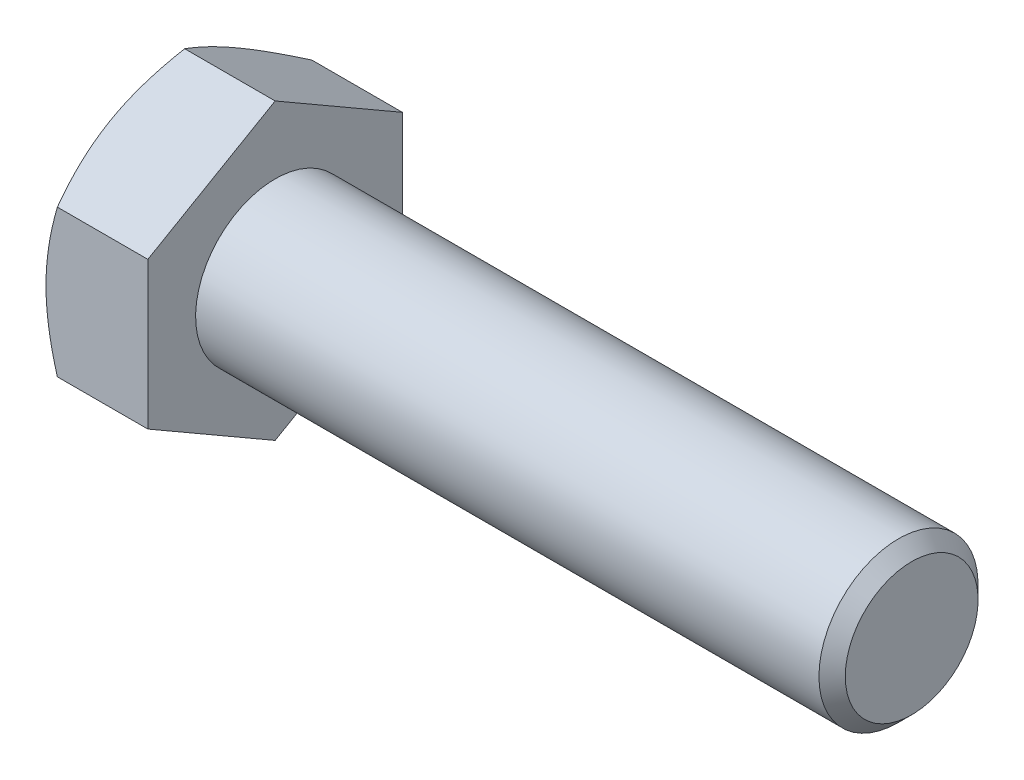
ISO-10303-21;
HEADER;
FILE_DESCRIPTION(('STEP AP214'),'2;1');
FILE_NAME('part.step','',(''),(''),'','','');
FILE_SCHEMA(('AUTOMOTIVE_DESIGN { 1 0 10303 214 1 1 1 1 }'));
ENDSEC;
DATA;
#1=APPLICATION_CONTEXT('core data for automotive mechanical design processes');
#2=APPLICATION_PROTOCOL_DEFINITION('international standard','automotive_design',2000,#1);
#3=PRODUCT_CONTEXT('',#1,'mechanical');
#4=PRODUCT('Part','Part','',(#3));
#5=PRODUCT_RELATED_PRODUCT_CATEGORY('part','',(#4));
#6=PRODUCT_DEFINITION_FORMATION('','',#4);
#7=PRODUCT_DEFINITION_CONTEXT('part definition',#1,'design');
#8=PRODUCT_DEFINITION('design','',#6,#7);
#9=PRODUCT_DEFINITION_SHAPE('','',#8);
#10=(LENGTH_UNIT() NAMED_UNIT(*) SI_UNIT(.MILLI.,.METRE.));
#11=(NAMED_UNIT(*) PLANE_ANGLE_UNIT() SI_UNIT($,.RADIAN.));
#12=(NAMED_UNIT(*) SI_UNIT($,.STERADIAN.) SOLID_ANGLE_UNIT());
#13=UNCERTAINTY_MEASURE_WITH_UNIT(LENGTH_MEASURE(1.E-05),#10,'distance_accuracy_value','');
#14=(GEOMETRIC_REPRESENTATION_CONTEXT(3) GLOBAL_UNCERTAINTY_ASSIGNED_CONTEXT((#13)) GLOBAL_UNIT_ASSIGNED_CONTEXT((#10,
#11,#12)) REPRESENTATION_CONTEXT('',''));
#15=CARTESIAN_POINT('',(0.,0.,0.));
#16=DIRECTION('',(0.,0.,1.));
#17=DIRECTION('',(1.,0.,0.));
#18=AXIS2_PLACEMENT_3D('',#15,#16,#17);
#19=CARTESIAN_POINT('',(0.,9.23760430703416,0.));
#20=DIRECTION('',(1.,0.,0.));
#21=DIRECTION('',(0.,1.,0.));
#22=AXIS2_PLACEMENT_3D('',#19,#20,#21);
#23=PLANE('',#22);
#24=CARTESIAN_POINT('',(0.,0.,0.));
#25=DIRECTION('',(1.,0.,0.));
#26=DIRECTION('',(0.,0.,-1.));
#27=AXIS2_PLACEMENT_3D('',#24,#25,#26);
#28=CIRCLE('',#27,8.00000000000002);
#29=CARTESIAN_POINT('',(0.,-6.92820323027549,-3.99999999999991));
#30=VERTEX_POINT('',#29);
#31=CARTESIAN_POINT('',(0.,0.,-7.99999999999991));
#32=VERTEX_POINT('',#31);
#33=EDGE_CURVE('E339',#30,#32,#28,.T.);
#34=ORIENTED_EDGE('',*,*,#33,.F.);
#35=CARTESIAN_POINT('',(0.,0.,0.));
#36=DIRECTION('',(1.,0.,0.));
#37=DIRECTION('',(0.,0.,-1.));
#38=AXIS2_PLACEMENT_3D('',#35,#36,#37);
#39=CIRCLE('',#38,8.);
#40=CARTESIAN_POINT('',(0.,-6.92820323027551,4.00000000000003));
#41=VERTEX_POINT('',#40);
#42=EDGE_CURVE('E338',#41,#30,#39,.T.);
#43=ORIENTED_EDGE('',*,*,#42,.F.);
#44=CARTESIAN_POINT('',(0.,0.,0.));
#45=DIRECTION('',(1.,0.,0.));
#46=DIRECTION('',(0.,0.,-1.));
#47=AXIS2_PLACEMENT_3D('',#44,#45,#46);
#48=CIRCLE('',#47,8.00000000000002);
#49=CARTESIAN_POINT('',(0.,0.,8.00000000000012));
#50=VERTEX_POINT('',#49);
#51=EDGE_CURVE('E88',#50,#41,#48,.T.);
#52=ORIENTED_EDGE('',*,*,#51,.F.);
#53=CARTESIAN_POINT('',(0.,0.,0.));
#54=DIRECTION('',(1.,0.,0.));
#55=DIRECTION('',(0.,0.,-1.));
#56=AXIS2_PLACEMENT_3D('',#53,#54,#55);
#57=CIRCLE('',#56,7.99999999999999);
#58=CARTESIAN_POINT('',(0.,6.92820323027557,4.00000000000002));
#59=VERTEX_POINT('',#58);
#60=EDGE_CURVE('E86',#59,#50,#57,.T.);
#61=ORIENTED_EDGE('',*,*,#60,.F.);
#62=CARTESIAN_POINT('',(0.,0.,0.));
#63=DIRECTION('',(1.,0.,0.));
#64=DIRECTION('',(0.,0.,-1.));
#65=AXIS2_PLACEMENT_3D('',#62,#63,#64);
#66=CIRCLE('',#65,8.);
#67=CARTESIAN_POINT('',(0.,6.92820323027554,-4.));
#68=VERTEX_POINT('',#67);
#69=EDGE_CURVE('E19',#68,#59,#66,.T.);
#70=ORIENTED_EDGE('',*,*,#69,.F.);
#71=CARTESIAN_POINT('',(0.,0.,0.));
#72=DIRECTION('',(1.,0.,0.));
#73=DIRECTION('',(0.,0.,-1.));
#74=AXIS2_PLACEMENT_3D('',#71,#72,#73);
#75=CIRCLE('',#74,7.99999999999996);
#76=EDGE_CURVE('E264',#32,#68,#75,.T.);
#77=ORIENTED_EDGE('',*,*,#76,.F.);
#78=EDGE_LOOP('',(#34,#43,#52,#61,#70,#77));
#79=FACE_BOUND('',#78,.T.);
#80=ADVANCED_FACE('F16',(#79),#23,.F.);
#81=CARTESIAN_POINT('',(0.718818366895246,0.,0.));
#82=DIRECTION('',(1.,0.,0.));
#83=DIRECTION('',(0.,0.,-1.));
#84=AXIS2_PLACEMENT_3D('',#81,#82,#83);
#85=CONICAL_SURFACE('',#84,9.24502993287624,1.0471975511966);
#86=CARTESIAN_POINT('',(0.714531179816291,9.23760430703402,0.));
#87=CARTESIAN_POINT('',(0.605971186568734,9.04962004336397,-0.325598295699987));
#88=CARTESIAN_POINT('',(0.506511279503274,8.8601303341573,-0.653804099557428));
#89=CARTESIAN_POINT('',(0.331115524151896,8.47948058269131,-1.31310880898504));
#90=CARTESIAN_POINT('',(0.255063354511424,8.28833381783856,-1.64418471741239));
#91=CARTESIAN_POINT('',(0.161684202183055,7.99980970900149,-2.14392313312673));
#92=CARTESIAN_POINT('',(0.133996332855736,7.90327053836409,-2.31113388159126));
#93=CARTESIAN_POINT('',(0.0860680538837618,7.70973002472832,-2.64635588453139));
#94=CARTESIAN_POINT('',(0.0658274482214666,7.61272869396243,-2.8143671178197));
#95=CARTESIAN_POINT('',(0.0331493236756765,7.41790506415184,-3.15181154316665));
#96=CARTESIAN_POINT('',(0.0207514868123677,7.32008108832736,-3.32124763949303));
#97=CARTESIAN_POINT('',(0.00415966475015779,7.1242407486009,-3.6604530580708));
#98=CARTESIAN_POINT('',(-3.26957018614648E-05,7.02622435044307,-3.83022243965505));
#99=CARTESIAN_POINT('',(0.,6.92820323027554,-4.));
#100=B_SPLINE_CURVE_WITH_KNOTS('',3,(#86,#87,#88,#89,#90,#91,#92,#93,#94,#95,#96,#97,#98,#99),
.UNSPECIFIED.,.F.,.F.,(4,2,2,2,2,2,4),(0.,1.17445865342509,2.34298309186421,2.9280119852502,
3.51302547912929,4.1009757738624,4.68904247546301),.UNSPECIFIED.);
#101=CARTESIAN_POINT('',(0.714531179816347,9.23760430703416,0.));
#102=VERTEX_POINT('',#101);
#103=EDGE_CURVE('E98',#102,#68,#100,.T.);
#104=ORIENTED_EDGE('',*,*,#103,.T.);
#105=ORIENTED_EDGE('',*,*,#69,.T.);
#106=CARTESIAN_POINT('',(0.,6.9282032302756,4.00000000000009));
#107=CARTESIAN_POINT('',(-3.26957018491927E-05,7.0262243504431,3.83022243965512));
#108=CARTESIAN_POINT('',(0.00415966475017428,7.12424074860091,3.66045305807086));
#109=CARTESIAN_POINT('',(0.0207514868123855,7.32008108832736,3.32124763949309));
#110=CARTESIAN_POINT('',(0.0331493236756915,7.41790506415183,3.15181154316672));
#111=CARTESIAN_POINT('',(0.0658274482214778,7.61272869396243,2.81436711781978));
#112=CARTESIAN_POINT('',(0.086068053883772,7.70973002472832,2.64635588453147));
#113=CARTESIAN_POINT('',(0.133996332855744,7.90327053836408,2.31113388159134));
#114=CARTESIAN_POINT('',(0.161684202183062,7.99980970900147,2.14392313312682));
#115=CARTESIAN_POINT('',(0.255063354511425,8.28833381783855,1.64418471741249));
#116=CARTESIAN_POINT('',(0.331115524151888,8.47948058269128,1.31310880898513));
#117=CARTESIAN_POINT('',(0.506511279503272,8.86013033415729,0.653804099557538));
#118=CARTESIAN_POINT('',(0.605971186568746,9.04962004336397,0.325598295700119));
#119=CARTESIAN_POINT('',(0.714531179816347,9.23760430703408,0.));
#120=B_SPLINE_CURVE_WITH_KNOTS('',3,(#106,#107,#108,#109,#110,#111,#112,#113,#114,#115,#116,
#117,#118,#119),.UNSPECIFIED.,.F.,.F.,(4,2,2,2,2,2,4),(0.,0.588066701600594,1.1760169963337,
1.76103049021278,2.34605938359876,3.51458382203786,4.68904247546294),.UNSPECIFIED.);
#121=EDGE_CURVE('E96',#59,#102,#120,.T.);
#122=ORIENTED_EDGE('',*,*,#121,.T.);
#123=EDGE_LOOP('',(#104,#105,#122));
#124=FACE_BOUND('',#123,.T.);
#125=ADVANCED_FACE('F94',(#124),#85,.T.);
#126=CARTESIAN_POINT('',(0.718818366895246,0.,0.));
#127=DIRECTION('',(1.,0.,0.));
#128=DIRECTION('',(0.,0.,-1.));
#129=AXIS2_PLACEMENT_3D('',#126,#127,#128);
#130=CONICAL_SURFACE('',#129,9.24502993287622,1.0471975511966);
#131=CARTESIAN_POINT('',(0.714531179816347,4.61880215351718,8.00000000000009));
#132=CARTESIAN_POINT('',(0.605971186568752,4.80678641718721,7.67440170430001));
#133=CARTESIAN_POINT('',(0.506511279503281,4.99627612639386,7.34619590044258));
#134=CARTESIAN_POINT('',(0.331115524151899,5.37692587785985,6.68689119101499));
#135=CARTESIAN_POINT('',(0.255063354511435,5.56807264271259,6.35581528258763));
#136=CARTESIAN_POINT('',(0.161684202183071,5.85659675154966,5.8560768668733));
#137=CARTESIAN_POINT('',(0.133996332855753,5.95313592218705,5.68886611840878));
#138=CARTESIAN_POINT('',(0.0860680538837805,6.14667643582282,5.35364411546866));
#139=CARTESIAN_POINT('',(0.0658274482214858,6.24367776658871,5.18563288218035));
#140=CARTESIAN_POINT('',(0.0331493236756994,6.4385013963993,4.84818845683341));
#141=CARTESIAN_POINT('',(0.020751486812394,6.53632537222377,4.67875236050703));
#142=CARTESIAN_POINT('',(0.00415966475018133,6.73216571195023,4.33954694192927));
#143=CARTESIAN_POINT('',(-3.26957018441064E-05,6.83018211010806,4.16977756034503));
#144=CARTESIAN_POINT('',(0.,6.9282032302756,4.00000000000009));
#145=B_SPLINE_CURVE_WITH_KNOTS('',3,(#131,#132,#133,#134,#135,#136,#137,#138,#139,#140,#141,
#142,#143,#144),.UNSPECIFIED.,.F.,.F.,(4,2,2,2,2,2,4),(0.,1.17445865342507,2.34298309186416,
2.92801198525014,3.51302547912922,4.10097577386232,4.68904247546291),.UNSPECIFIED.);
#146=CARTESIAN_POINT('',(0.714531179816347,4.61880215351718,8.00000000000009));
#147=VERTEX_POINT('',#146);
#148=EDGE_CURVE('E101',#147,#59,#145,.T.);
#149=ORIENTED_EDGE('',*,*,#148,.T.);
#150=ORIENTED_EDGE('',*,*,#60,.T.);
#151=CARTESIAN_POINT('',(0.,0.,8.00000000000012));
#152=CARTESIAN_POINT('',(-3.26957018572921E-05,0.196042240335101,8.00000000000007));
#153=CARTESIAN_POINT('',(0.00415966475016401,0.39207503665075,8.00000000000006));
#154=CARTESIAN_POINT('',(0.0207514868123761,0.783755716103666,8.00000000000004));
#155=CARTESIAN_POINT('',(0.0331493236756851,0.979403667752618,8.00000000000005));
#156=CARTESIAN_POINT('',(0.0658274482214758,1.36905092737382,8.00000000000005));
#157=CARTESIAN_POINT('',(0.0860680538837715,1.5630535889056,8.00000000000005));
#158=CARTESIAN_POINT('',(0.133996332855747,1.95013461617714,8.00000000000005));
#159=CARTESIAN_POINT('',(0.161684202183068,2.14321295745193,8.00000000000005));
#160=CARTESIAN_POINT('',(0.255063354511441,2.72026117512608,8.00000000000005));
#161=CARTESIAN_POINT('',(0.331115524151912,3.10255470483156,8.00000000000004));
#162=CARTESIAN_POINT('',(0.506511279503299,3.86385420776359,8.00000000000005));
#163=CARTESIAN_POINT('',(0.605971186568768,4.24283362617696,8.00000000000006));
#164=CARTESIAN_POINT('',(0.714531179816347,4.61880215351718,8.00000000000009));
#165=B_SPLINE_CURVE_WITH_KNOTS('',3,(#151,#152,#153,#154,#155,#156,#157,#158,#159,#160,#161,
#162,#163,#164),.UNSPECIFIED.,.F.,.F.,(4,2,2,2,2,2,4),(0.,0.588066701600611,1.17601699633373,
1.76103049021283,2.34605938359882,3.51458382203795,4.68904247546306),.UNSPECIFIED.);
#166=EDGE_CURVE('E104',#50,#147,#165,.T.);
#167=ORIENTED_EDGE('',*,*,#166,.T.);
#168=EDGE_LOOP('',(#149,#150,#167));
#169=FACE_BOUND('',#168,.T.);
#170=ADVANCED_FACE('F102',(#169),#130,.T.);
#171=CARTESIAN_POINT('',(0.718818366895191,0.,0.));
#172=DIRECTION('',(1.,0.,0.));
#173=DIRECTION('',(0.,0.,-1.));
#174=AXIS2_PLACEMENT_3D('',#171,#172,#173);
#175=CONICAL_SURFACE('',#174,9.24502993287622,1.0471975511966);
#176=ORIENTED_EDGE('',*,*,#51,.T.);
#177=CARTESIAN_POINT('',(0.,-6.92820323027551,4.00000000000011));
#178=CARTESIAN_POINT('',(-3.26957018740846E-05,-6.83018211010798,4.16977756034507));
#179=CARTESIAN_POINT('',(0.00415966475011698,-6.73216571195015,4.33954694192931));
#180=CARTESIAN_POINT('',(0.0207514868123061,-6.53632537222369,4.67875236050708));
#181=CARTESIAN_POINT('',(0.0331493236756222,-6.43850139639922,4.84818845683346));
#182=CARTESIAN_POINT('',(0.0658274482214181,-6.24367776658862,5.1856328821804));
#183=CARTESIAN_POINT('',(0.0860680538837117,-6.14667643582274,5.35364411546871));
#184=CARTESIAN_POINT('',(0.133996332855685,-5.95313592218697,5.68886611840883));
#185=CARTESIAN_POINT('',(0.161684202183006,-5.85659675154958,5.85607686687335));
#186=CARTESIAN_POINT('',(0.255063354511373,-5.56807264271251,6.35581528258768));
#187=CARTESIAN_POINT('',(0.331115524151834,-5.37692587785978,6.68689119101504));
#188=CARTESIAN_POINT('',(0.506511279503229,-4.99627612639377,7.34619590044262));
#189=CARTESIAN_POINT('',(0.605971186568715,-4.8067864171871,7.67440170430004));
#190=CARTESIAN_POINT('',(0.714531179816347,-4.61880215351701,8.00000000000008));
#191=B_SPLINE_CURVE_WITH_KNOTS('',3,(#177,#178,#179,#180,#181,#182,#183,#184,#185,#186,#187,
#188,#189,#190),.UNSPECIFIED.,.F.,.F.,(4,2,2,2,2,2,4),(0.,0.5880667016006,1.1760169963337,
1.76103049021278,2.34605938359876,3.51458382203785,4.68904247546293),.UNSPECIFIED.);
#192=CARTESIAN_POINT('',(0.714531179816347,-4.61880215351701,8.00000000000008));
#193=VERTEX_POINT('',#192);
#194=EDGE_CURVE('E179',#41,#193,#191,.T.);
#195=ORIENTED_EDGE('',*,*,#194,.T.);
#196=CARTESIAN_POINT('',(0.714531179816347,-4.61880215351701,8.00000000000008));
#197=CARTESIAN_POINT('',(0.605971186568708,-4.24283362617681,8.00000000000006));
#198=CARTESIAN_POINT('',(0.506511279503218,-3.86385420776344,8.00000000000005));
#199=CARTESIAN_POINT('',(0.331115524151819,-3.10255470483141,8.00000000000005));
#200=CARTESIAN_POINT('',(0.255063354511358,-2.72026117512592,8.00000000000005));
#201=CARTESIAN_POINT('',(0.161684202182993,-2.14321295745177,8.00000000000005));
#202=CARTESIAN_POINT('',(0.133996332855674,-1.95013461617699,8.00000000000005));
#203=CARTESIAN_POINT('',(0.0860680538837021,-1.56305358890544,8.00000000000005));
#204=CARTESIAN_POINT('',(0.0658274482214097,-1.36905092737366,8.00000000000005));
#205=CARTESIAN_POINT('',(0.0331493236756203,-0.979403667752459,8.00000000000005));
#206=CARTESIAN_POINT('',(0.0207514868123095,-0.783755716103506,8.00000000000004));
#207=CARTESIAN_POINT('',(0.00415966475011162,-0.392075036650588,8.00000000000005));
#208=CARTESIAN_POINT('',(-3.26957018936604E-05,-0.196042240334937,8.00000000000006));
#209=CARTESIAN_POINT('',(0.,1.11022302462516E-13,8.00000000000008));
#210=B_SPLINE_CURVE_WITH_KNOTS('',3,(#196,#197,#198,#199,#200,#201,#202,#203,#204,#205,#206,
#207,#208,#209),.UNSPECIFIED.,.F.,.F.,(4,2,2,2,2,2,4),(0.,1.17445865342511,2.34298309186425,
2.92801198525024,3.51302547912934,4.10097577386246,4.68904247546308),.UNSPECIFIED.);
#211=EDGE_CURVE('E151',#193,#50,#210,.T.);
#212=ORIENTED_EDGE('',*,*,#211,.T.);
#213=EDGE_LOOP('',(#176,#195,#212));
#214=FACE_BOUND('',#213,.T.);
#215=ADVANCED_FACE('F141',(#214),#175,.T.);
#216=CARTESIAN_POINT('',(0.718818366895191,0.,0.));
#217=DIRECTION('',(1.,0.,0.));
#218=DIRECTION('',(0.,0.,-1.));
#219=AXIS2_PLACEMENT_3D('',#216,#217,#218);
#220=CONICAL_SURFACE('',#219,9.24502993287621,1.0471975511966);
#221=ORIENTED_EDGE('',*,*,#42,.T.);
#222=CARTESIAN_POINT('',(0.,-6.92820323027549,-3.99999999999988));
#223=CARTESIAN_POINT('',(-3.26957020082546E-05,-7.02622435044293,-3.83022243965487));
#224=CARTESIAN_POINT('',(0.00415966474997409,-7.12424074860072,-3.6604530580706));
#225=CARTESIAN_POINT('',(0.0207514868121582,-7.32008108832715,-3.32124763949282));
#226=CARTESIAN_POINT('',(0.0331493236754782,-7.41790506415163,-3.15181154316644));
#227=CARTESIAN_POINT('',(0.0658274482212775,-7.61272869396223,-2.81436711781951));
#228=CARTESIAN_POINT('',(0.0860680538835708,-7.70973002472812,-2.64635588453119));
#229=CARTESIAN_POINT('',(0.133996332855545,-7.90327053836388,-2.31113388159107));
#230=CARTESIAN_POINT('',(0.161684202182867,-7.99980970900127,-2.14392313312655));
#231=CARTESIAN_POINT('',(0.255063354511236,-8.28833381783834,-1.64418471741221));
#232=CARTESIAN_POINT('',(0.331115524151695,-8.47948058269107,-1.31310880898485));
#233=CARTESIAN_POINT('',(0.506511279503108,-8.86013033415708,-0.653804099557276));
#234=CARTESIAN_POINT('',(0.605971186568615,-9.04962004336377,-0.325598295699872));
#235=CARTESIAN_POINT('',(0.714531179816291,-9.23760430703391,1.2490009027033E-13));
#236=B_SPLINE_CURVE_WITH_KNOTS('',3,(#222,#223,#224,#225,#226,#227,#228,#229,#230,#231,#232,
#233,#234,#235),.UNSPECIFIED.,.F.,.F.,(4,2,2,2,2,2,4),(0.,0.588066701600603,1.17601699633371,
1.76103049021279,2.34605938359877,3.51458382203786,4.68904247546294),.UNSPECIFIED.);
#237=CARTESIAN_POINT('',(0.714531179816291,-9.23760430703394,0.));
#238=VERTEX_POINT('',#237);
#239=EDGE_CURVE('E311',#30,#238,#236,.T.);
#240=ORIENTED_EDGE('',*,*,#239,.T.);
#241=CARTESIAN_POINT('',(0.714531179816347,-9.23760430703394,0.));
#242=CARTESIAN_POINT('',(0.605971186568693,-9.04962004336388,0.325598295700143));
#243=CARTESIAN_POINT('',(0.506511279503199,-8.86013033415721,0.653804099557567));
#244=CARTESIAN_POINT('',(0.331115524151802,-8.47948058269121,1.31310880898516));
#245=CARTESIAN_POINT('',(0.255063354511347,-8.28833381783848,1.64418471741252));
#246=CARTESIAN_POINT('',(0.161684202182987,-7.99980970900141,2.14392313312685));
#247=CARTESIAN_POINT('',(0.133996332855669,-7.90327053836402,2.31113388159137));
#248=CARTESIAN_POINT('',(0.0860680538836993,-7.70973002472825,2.64635588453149));
#249=CARTESIAN_POINT('',(0.0658274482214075,-7.61272869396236,2.8143671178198));
#250=CARTESIAN_POINT('',(0.0331493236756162,-7.41790506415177,3.15181154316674));
#251=CARTESIAN_POINT('',(0.0207514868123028,-7.32008108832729,3.32124763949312));
#252=CARTESIAN_POINT('',(0.00415966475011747,-7.12424074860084,3.66045305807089));
#253=CARTESIAN_POINT('',(-3.26957018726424E-05,-7.02622435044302,3.83022243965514));
#254=CARTESIAN_POINT('',(0.,-6.92820323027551,4.00000000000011));
#255=B_SPLINE_CURVE_WITH_KNOTS('',3,(#241,#242,#243,#244,#245,#246,#247,#248,#249,#250,#251,
#252,#253,#254),.UNSPECIFIED.,.F.,.F.,(4,2,2,2,2,2,4),(0.,1.17445865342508,2.34298309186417,
2.92801198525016,3.51302547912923,4.10097577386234,4.68904247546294),.UNSPECIFIED.);
#256=EDGE_CURVE('E173',#238,#41,#255,.T.);
#257=ORIENTED_EDGE('',*,*,#256,.T.);
#258=EDGE_LOOP('',(#221,#240,#257));
#259=FACE_BOUND('',#258,.T.);
#260=ADVANCED_FACE('F329',(#259),#220,.T.);
#261=CARTESIAN_POINT('',(0.718818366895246,0.,0.));
#262=DIRECTION('',(1.,0.,0.));
#263=DIRECTION('',(0.,0.,-1.));
#264=AXIS2_PLACEMENT_3D('',#261,#262,#263);
#265=CONICAL_SURFACE('',#264,9.24502993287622,1.0471975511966);
#266=ORIENTED_EDGE('',*,*,#33,.T.);
#267=CARTESIAN_POINT('',(0.,0.,-7.99999999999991));
#268=CARTESIAN_POINT('',(-3.2695701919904E-05,-0.196042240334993,-7.99999999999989));
#269=CARTESIAN_POINT('',(0.00415966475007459,-0.392075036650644,-7.99999999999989));
#270=CARTESIAN_POINT('',(0.0207514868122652,-0.783755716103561,-7.99999999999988));
#271=CARTESIAN_POINT('',(0.0331493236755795,-0.979403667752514,-7.99999999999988));
#272=CARTESIAN_POINT('',(0.0658274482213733,-1.36905092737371,-7.99999999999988));
#273=CARTESIAN_POINT('',(0.0860680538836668,-1.56305358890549,-7.99999999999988));
#274=CARTESIAN_POINT('',(0.13399633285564,-1.95013461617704,-7.99999999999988));
#275=CARTESIAN_POINT('',(0.16168420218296,-2.14321295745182,-7.99999999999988));
#276=CARTESIAN_POINT('',(0.255063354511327,-2.72026117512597,-7.99999999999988));
#277=CARTESIAN_POINT('',(0.331115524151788,-3.10255470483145,-7.99999999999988));
#278=CARTESIAN_POINT('',(0.506511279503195,-3.86385420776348,-7.99999999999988));
#279=CARTESIAN_POINT('',(0.605971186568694,-4.24283362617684,-7.99999999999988));
#280=CARTESIAN_POINT('',(0.714531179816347,-4.61880215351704,-7.99999999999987));
#281=B_SPLINE_CURVE_WITH_KNOTS('',3,(#267,#268,#269,#270,#271,#272,#273,#274,#275,#276,#277,
#278,#279,#280),.UNSPECIFIED.,.F.,.F.,(4,2,2,2,2,2,4),(0.,0.588066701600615,1.17601699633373,
1.76103049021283,2.34605938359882,3.51458382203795,4.68904247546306),.UNSPECIFIED.);
#282=CARTESIAN_POINT('',(0.714531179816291,-4.61880215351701,-7.9999999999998));
#283=VERTEX_POINT('',#282);
#284=EDGE_CURVE('E240',#32,#283,#281,.T.);
#285=ORIENTED_EDGE('',*,*,#284,.T.);
#286=CARTESIAN_POINT('',(0.714531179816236,-4.61880215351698,-7.99999999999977));
#287=CARTESIAN_POINT('',(0.605971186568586,-4.80678641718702,-7.67440170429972));
#288=CARTESIAN_POINT('',(0.506511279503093,-4.99627612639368,-7.3461959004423));
#289=CARTESIAN_POINT('',(0.331115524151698,-5.37692587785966,-6.68689119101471));
#290=CARTESIAN_POINT('',(0.255063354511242,-5.5680726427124,-6.35581528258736));
#291=CARTESIAN_POINT('',(0.161684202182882,-5.85659675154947,-5.85607686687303));
#292=CARTESIAN_POINT('',(0.133996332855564,-5.95313592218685,-5.68886611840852));
#293=CARTESIAN_POINT('',(0.0860680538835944,-6.14667643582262,-5.3536441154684));
#294=CARTESIAN_POINT('',(0.065827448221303,-6.24367776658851,-5.18563288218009));
#295=CARTESIAN_POINT('',(0.0331493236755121,-6.43850139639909,-4.84818845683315));
#296=CARTESIAN_POINT('',(0.0207514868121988,-6.53632537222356,-4.67875236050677));
#297=CARTESIAN_POINT('',(0.00415966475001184,-6.73216571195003,-4.33954694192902));
#298=CARTESIAN_POINT('',(-3.26957019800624E-05,-6.83018211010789,-4.16977756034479));
#299=CARTESIAN_POINT('',(0.,-6.92820323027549,-3.99999999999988));
#300=B_SPLINE_CURVE_WITH_KNOTS('',3,(#286,#287,#288,#289,#290,#291,#292,#293,#294,#295,#296,
#297,#298,#299),.UNSPECIFIED.,.F.,.F.,(4,2,2,2,2,2,4),(0.,1.17445865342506,2.34298309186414,
2.92801198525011,3.51302547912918,4.10097577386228,4.68904247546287),.UNSPECIFIED.);
#301=EDGE_CURVE('E310',#283,#30,#300,.T.);
#302=ORIENTED_EDGE('',*,*,#301,.T.);
#303=EDGE_LOOP('',(#266,#285,#302));
#304=FACE_BOUND('',#303,.T.);
#305=ADVANCED_FACE('F255',(#304),#265,.T.);
#306=CARTESIAN_POINT('',(0.718818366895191,0.,0.));
#307=DIRECTION('',(1.,0.,0.));
#308=DIRECTION('',(0.,0.,-1.));
#309=AXIS2_PLACEMENT_3D('',#306,#307,#308);
#310=CONICAL_SURFACE('',#309,9.24502993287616,1.0471975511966);
#311=CARTESIAN_POINT('',(0.714531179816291,4.61880215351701,-7.9999999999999));
#312=CARTESIAN_POINT('',(0.605971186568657,4.24283362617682,-7.99999999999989));
#313=CARTESIAN_POINT('',(0.506511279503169,3.86385420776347,-7.99999999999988));
#314=CARTESIAN_POINT('',(0.331115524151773,3.10255470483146,-7.99999999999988));
#315=CARTESIAN_POINT('',(0.255063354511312,2.720261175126,-7.99999999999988));
#316=CARTESIAN_POINT('',(0.161684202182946,2.14321295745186,-7.99999999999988));
#317=CARTESIAN_POINT('',(0.133996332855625,1.95013461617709,-7.99999999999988));
#318=CARTESIAN_POINT('',(0.0860680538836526,1.56305358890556,-7.99999999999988));
#319=CARTESIAN_POINT('',(0.0658274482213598,1.36905092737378,-7.99999999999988));
#320=CARTESIAN_POINT('',(0.033149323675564,0.979403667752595,-7.99999999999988));
#321=CARTESIAN_POINT('',(0.0207514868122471,0.783755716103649,-7.99999999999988));
#322=CARTESIAN_POINT('',(0.00415966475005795,0.392075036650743,-7.99999999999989));
#323=CARTESIAN_POINT('',(-3.2695701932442E-05,0.196042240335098,-7.99999999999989));
#324=CARTESIAN_POINT('',(0.,0.,-7.99999999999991));
#325=B_SPLINE_CURVE_WITH_KNOTS('',3,(#311,#312,#313,#314,#315,#316,#317,#318,#319,#320,#321,
#322,#323,#324),.UNSPECIFIED.,.F.,.F.,(4,2,2,2,2,2,4),(0.,1.17445865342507,2.34298309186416,
2.92801198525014,3.51302547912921,4.10097577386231,4.68904247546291),.UNSPECIFIED.);
#326=CARTESIAN_POINT('',(0.714531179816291,4.61880215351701,-7.9999999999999));
#327=VERTEX_POINT('',#326);
#328=EDGE_CURVE('E231',#327,#32,#325,.T.);
#329=ORIENTED_EDGE('',*,*,#328,.T.);
#330=ORIENTED_EDGE('',*,*,#76,.T.);
#331=CARTESIAN_POINT('',(0.,6.92820323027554,-4.));
#332=CARTESIAN_POINT('',(-3.26957018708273E-05,6.83018211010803,-4.16977756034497));
#333=CARTESIAN_POINT('',(0.00415966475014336,6.73216571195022,-4.33954694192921));
#334=CARTESIAN_POINT('',(0.020751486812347,6.53632537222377,-4.67875236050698));
#335=CARTESIAN_POINT('',(0.0331493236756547,6.43850139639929,-4.84818845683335));
#336=CARTESIAN_POINT('',(0.0658274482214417,6.2436777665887,-5.18563288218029));
#337=CARTESIAN_POINT('',(0.0860680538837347,6.14667643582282,-5.3536441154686));
#338=CARTESIAN_POINT('',(0.133996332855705,5.95313592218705,-5.68886611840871));
#339=CARTESIAN_POINT('',(0.161684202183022,5.85659675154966,-5.85607686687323));
#340=CARTESIAN_POINT('',(0.255063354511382,5.5680726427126,-6.35581528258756));
#341=CARTESIAN_POINT('',(0.331115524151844,5.37692587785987,-6.68689119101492));
#342=CARTESIAN_POINT('',(0.506511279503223,4.99627612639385,-7.34619590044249));
#343=CARTESIAN_POINT('',(0.605971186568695,4.80678641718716,-7.67440170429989));
#344=CARTESIAN_POINT('',(0.714531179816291,4.61880215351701,-7.9999999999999));
#345=B_SPLINE_CURVE_WITH_KNOTS('',3,(#331,#332,#333,#334,#335,#336,#337,#338,#339,#340,#341,
#342,#343,#344),.UNSPECIFIED.,.F.,.F.,(4,2,2,2,2,2,4),(0.,0.588066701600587,1.17601699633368,
1.76103049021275,2.34605938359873,3.51458382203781,4.68904247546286),.UNSPECIFIED.);
#346=EDGE_CURVE('E114',#68,#327,#345,.T.);
#347=ORIENTED_EDGE('',*,*,#346,.T.);
#348=EDGE_LOOP('',(#329,#330,#347));
#349=FACE_BOUND('',#348,.T.);
#350=ADVANCED_FACE('F250',(#349),#310,.T.);
#351=CARTESIAN_POINT('',(46.4,5.55111512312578E-13,0.));
#352=DIRECTION('',(-1.,0.,0.));
#353=DIRECTION('',(0.,-1.,0.));
#354=AXIS2_PLACEMENT_3D('',#351,#352,#353);
#355=PLANE('',#354);
#356=CARTESIAN_POINT('',(46.3999999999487,5.55111512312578E-13,0.));
#357=DIRECTION('',(-1.,0.,0.));
#358=DIRECTION('',(0.,0.,1.));
#359=AXIS2_PLACEMENT_3D('',#356,#357,#358);
#360=CIRCLE('',#359,4.17199999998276);
#361=CARTESIAN_POINT('',(46.3999999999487,5.55111512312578E-13,4.17199999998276));
#362=VERTEX_POINT('',#361);
#363=EDGE_CURVE('E202',#362,#362,#360,.T.);
#364=ORIENTED_EDGE('',*,*,#363,.F.);
#365=EDGE_LOOP('',(#364));
#366=FACE_BOUND('',#365,.T.);
#367=ADVANCED_FACE('F254',(#366),#355,.F.);
#368=CARTESIAN_POINT('',(6.39999999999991,4.61880215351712,-7.99999999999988));
#369=DIRECTION('',(0.,-0.866025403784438,0.500000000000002));
#370=DIRECTION('',(0.,-0.500000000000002,-0.866025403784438));
#371=AXIS2_PLACEMENT_3D('',#368,#369,#370);
#372=PLANE('',#371);
#373=DIRECTION('',(1.,0.,0.));
#374=VECTOR('',#373,1.);
#375=CARTESIAN_POINT('',(6.40000000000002,9.23760430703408,0.));
#376=LINE('',#375,#374);
#377=CARTESIAN_POINT('',(6.40000000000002,9.23760430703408,0.));
#378=VERTEX_POINT('',#377);
#379=EDGE_CURVE('E107',#102,#378,#376,.T.);
#380=ORIENTED_EDGE('',*,*,#379,.T.);
#381=DIRECTION('',(0.,0.500000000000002,0.866025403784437));
#382=VECTOR('',#381,1.);
#383=CARTESIAN_POINT('',(6.40000000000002,4.61880215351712,-7.99999999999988));
#384=LINE('',#383,#382);
#385=CARTESIAN_POINT('',(6.39999999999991,4.61880215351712,-7.99999999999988));
#386=VERTEX_POINT('',#385);
#387=EDGE_CURVE('E198',#386,#378,#384,.T.);
#388=ORIENTED_EDGE('',*,*,#387,.F.);
#389=DIRECTION('',(1.,0.,0.));
#390=VECTOR('',#389,1.);
#391=CARTESIAN_POINT('',(6.39999999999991,4.61880215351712,-7.99999999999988));
#392=LINE('',#391,#390);
#393=EDGE_CURVE('E239',#386,#327,#392,.F.);
#394=ORIENTED_EDGE('',*,*,#393,.T.);
#395=ORIENTED_EDGE('',*,*,#346,.F.);
#396=ORIENTED_EDGE('',*,*,#103,.F.);
#397=EDGE_LOOP('',(#380,#388,#394,#395,#396));
#398=FACE_BOUND('',#397,.T.);
#399=ADVANCED_FACE('F266',(#398),#372,.F.);
#400=CARTESIAN_POINT('',(6.40000000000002,9.23760430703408,0.));
#401=DIRECTION('',(0.,-0.866025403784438,-0.500000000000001));
#402=DIRECTION('',(0.,0.500000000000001,-0.866025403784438));
#403=AXIS2_PLACEMENT_3D('',#400,#401,#402);
#404=PLANE('',#403);
#405=DIRECTION('',(-1.,0.,0.));
#406=VECTOR('',#405,1.);
#407=CARTESIAN_POINT('',(6.40000000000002,4.61880215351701,8.00000000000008));
#408=LINE('',#407,#406);
#409=CARTESIAN_POINT('',(6.40000000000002,4.61880215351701,8.00000000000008));
#410=VERTEX_POINT('',#409);
#411=EDGE_CURVE('E150',#147,#410,#408,.F.);
#412=ORIENTED_EDGE('',*,*,#411,.T.);
#413=DIRECTION('',(0.,-0.500000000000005,0.866025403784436));
#414=VECTOR('',#413,1.);
#415=CARTESIAN_POINT('',(6.40000000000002,9.23760430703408,0.));
#416=LINE('',#415,#414);
#417=EDGE_CURVE('E201',#378,#410,#416,.T.);
#418=ORIENTED_EDGE('',*,*,#417,.F.);
#419=ORIENTED_EDGE('',*,*,#379,.F.);
#420=ORIENTED_EDGE('',*,*,#121,.F.);
#421=ORIENTED_EDGE('',*,*,#148,.F.);
#422=EDGE_LOOP('',(#412,#418,#419,#420,#421));
#423=FACE_BOUND('',#422,.T.);
#424=ADVANCED_FACE('F110',(#423),#404,.F.);
#425=CARTESIAN_POINT('',(6.40000000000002,4.61880215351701,8.00000000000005));
#426=DIRECTION('',(0.,0.,-1.));
#427=DIRECTION('',(-1.,0.,0.));
#428=AXIS2_PLACEMENT_3D('',#425,#426,#427);
#429=PLANE('',#428);
#430=DIRECTION('',(1.,0.,0.));
#431=VECTOR('',#430,1.);
#432=CARTESIAN_POINT('',(6.39999999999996,-4.61880215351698,8.0000000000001));
#433=LINE('',#432,#431);
#434=CARTESIAN_POINT('',(6.39999999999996,-4.61880215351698,8.0000000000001));
#435=VERTEX_POINT('',#434);
#436=EDGE_CURVE('E184',#193,#435,#433,.T.);
#437=ORIENTED_EDGE('',*,*,#436,.T.);
#438=DIRECTION('',(0.,1.,0.));
#439=VECTOR('',#438,1.);
#440=CARTESIAN_POINT('',(6.39999999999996,9.23760430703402,8.00000000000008));
#441=LINE('',#440,#439);
#442=EDGE_CURVE('E218',#410,#435,#441,.F.);
#443=ORIENTED_EDGE('',*,*,#442,.F.);
#444=ORIENTED_EDGE('',*,*,#411,.F.);
#445=ORIENTED_EDGE('',*,*,#166,.F.);
#446=ORIENTED_EDGE('',*,*,#211,.F.);
#447=EDGE_LOOP('',(#437,#443,#444,#445,#446));
#448=FACE_BOUND('',#447,.T.);
#449=ADVANCED_FACE('F157',(#448),#429,.F.);
#450=CARTESIAN_POINT('',(6.39999999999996,-9.23760430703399,1.2490009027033E-13));
#451=DIRECTION('',(0.,0.866025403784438,-0.500000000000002));
#452=DIRECTION('',(0.,0.500000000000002,0.866025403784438));
#453=AXIS2_PLACEMENT_3D('',#450,#451,#452);
#454=PLANE('',#453);
#455=DIRECTION('',(1.,0.,0.));
#456=VECTOR('',#455,1.);
#457=CARTESIAN_POINT('',(6.39999999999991,-9.23760430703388,0.));
#458=LINE('',#457,#456);
#459=CARTESIAN_POINT('',(6.39999999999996,-9.23760430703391,0.));
#460=VERTEX_POINT('',#459);
#461=EDGE_CURVE('E308',#238,#460,#458,.T.);
#462=ORIENTED_EDGE('',*,*,#461,.T.);
#463=DIRECTION('',(0.,-0.500000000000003,-0.866025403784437));
#464=VECTOR('',#463,1.);
#465=CARTESIAN_POINT('',(6.39999999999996,-4.61880215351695,8.00000000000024));
#466=LINE('',#465,#464);
#467=EDGE_CURVE('E213',#435,#460,#466,.T.);
#468=ORIENTED_EDGE('',*,*,#467,.F.);
#469=ORIENTED_EDGE('',*,*,#436,.F.);
#470=ORIENTED_EDGE('',*,*,#194,.F.);
#471=ORIENTED_EDGE('',*,*,#256,.F.);
#472=EDGE_LOOP('',(#462,#468,#469,#470,#471));
#473=FACE_BOUND('',#472,.T.);
#474=ADVANCED_FACE('F161',(#473),#454,.F.);
#475=CARTESIAN_POINT('',(6.39999999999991,-4.61880215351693,-7.99999999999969));
#476=DIRECTION('',(0.,0.866025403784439,0.5));
#477=DIRECTION('',(0.,-0.5,0.866025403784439));
#478=AXIS2_PLACEMENT_3D('',#475,#476,#477);
#479=PLANE('',#478);
#480=DIRECTION('',(1.,0.,0.));
#481=VECTOR('',#480,1.);
#482=CARTESIAN_POINT('',(6.39999999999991,-4.61880215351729,-7.99999999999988));
#483=LINE('',#482,#481);
#484=CARTESIAN_POINT('',(6.39999999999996,-4.61880215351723,-7.99999999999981));
#485=VERTEX_POINT('',#484);
#486=EDGE_CURVE('E34',#283,#485,#483,.T.);
#487=ORIENTED_EDGE('',*,*,#486,.T.);
#488=DIRECTION('',(0.,0.500000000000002,-0.866025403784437));
#489=VECTOR('',#488,1.);
#490=CARTESIAN_POINT('',(6.39999999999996,-9.23760430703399,1.2490009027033E-13));
#491=LINE('',#490,#489);
#492=EDGE_CURVE('E208',#460,#485,#491,.T.);
#493=ORIENTED_EDGE('',*,*,#492,.F.);
#494=ORIENTED_EDGE('',*,*,#461,.F.);
#495=ORIENTED_EDGE('',*,*,#239,.F.);
#496=ORIENTED_EDGE('',*,*,#301,.F.);
#497=EDGE_LOOP('',(#487,#493,#494,#495,#496));
#498=FACE_BOUND('',#497,.T.);
#499=ADVANCED_FACE('F167',(#498),#479,.F.);
#500=CARTESIAN_POINT('',(6.39999999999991,4.61880215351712,-7.99999999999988));
#501=DIRECTION('',(0.,0.,1.));
#502=DIRECTION('',(1.,0.,0.));
#503=AXIS2_PLACEMENT_3D('',#500,#501,#502);
#504=PLANE('',#503);
#505=ORIENTED_EDGE('',*,*,#393,.F.);
#506=DIRECTION('',(0.,1.,0.));
#507=VECTOR('',#506,1.);
#508=CARTESIAN_POINT('',(6.40000000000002,9.23760430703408,-7.99999999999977));
#509=LINE('',#508,#507);
#510=EDGE_CURVE('E205',#485,#386,#509,.T.);
#511=ORIENTED_EDGE('',*,*,#510,.F.);
#512=ORIENTED_EDGE('',*,*,#486,.F.);
#513=ORIENTED_EDGE('',*,*,#284,.F.);
#514=ORIENTED_EDGE('',*,*,#328,.F.);
#515=EDGE_LOOP('',(#505,#511,#512,#513,#514));
#516=FACE_BOUND('',#515,.T.);
#517=ADVANCED_FACE('F247',(#516),#504,.F.);
#518=CARTESIAN_POINT('',(45.571999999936,4.9960036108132E-13,0.));
#519=DIRECTION('',(-1.,0.,0.));
#520=DIRECTION('',(0.,0.,1.));
#521=AXIS2_PLACEMENT_3D('',#518,#519,#520);
#522=CONICAL_SURFACE('',#521,4.99999999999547,0.785398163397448);
#523=ORIENTED_EDGE('',*,*,#363,.T.);
#524=EDGE_LOOP('',(#523));
#525=FACE_BOUND('',#524,.T.);
#526=CARTESIAN_POINT('',(45.572,0.,0.));
#527=DIRECTION('',(-1.,0.,0.));
#528=DIRECTION('',(0.,-1.,0.));
#529=AXIS2_PLACEMENT_3D('',#526,#527,#528);
#530=CIRCLE('',#529,5.);
#531=CARTESIAN_POINT('',(45.572,-5.,0.));
#532=VERTEX_POINT('',#531);
#533=EDGE_CURVE('E25',#532,#532,#530,.T.);
#534=ORIENTED_EDGE('',*,*,#533,.F.);
#535=EDGE_LOOP('',(#534));
#536=FACE_BOUND('',#535,.T.);
#537=ADVANCED_FACE('F285',(#525,#536),#522,.T.);
#538=CARTESIAN_POINT('',(6.40000000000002,9.23760430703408,0.));
#539=DIRECTION('',(1.,0.,0.));
#540=DIRECTION('',(0.,1.,0.));
#541=AXIS2_PLACEMENT_3D('',#538,#539,#540);
#542=PLANE('',#541);
#543=ORIENTED_EDGE('',*,*,#492,.T.);
#544=ORIENTED_EDGE('',*,*,#510,.T.);
#545=ORIENTED_EDGE('',*,*,#387,.T.);
#546=ORIENTED_EDGE('',*,*,#417,.T.);
#547=ORIENTED_EDGE('',*,*,#442,.T.);
#548=ORIENTED_EDGE('',*,*,#467,.T.);
#549=EDGE_LOOP('',(#543,#544,#545,#546,#547,#548));
#550=FACE_BOUND('',#549,.T.);
#551=CARTESIAN_POINT('',(6.39999999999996,0.,0.));
#552=DIRECTION('',(-1.,0.,0.));
#553=DIRECTION('',(0.,-1.,0.));
#554=AXIS2_PLACEMENT_3D('',#551,#552,#553);
#555=CIRCLE('',#554,5.);
#556=CARTESIAN_POINT('',(6.39999999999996,-4.99999999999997,0.));
#557=VERTEX_POINT('',#556);
#558=EDGE_CURVE('E11',#557,#557,#555,.F.);
#559=ORIENTED_EDGE('',*,*,#558,.F.);
#560=EDGE_LOOP('',(#559));
#561=FACE_BOUND('',#560,.T.);
#562=ADVANCED_FACE('F279',(#550,#561),#542,.T.);
#563=CARTESIAN_POINT('',(0.,0.,0.));
#564=DIRECTION('',(-1.,0.,0.));
#565=DIRECTION('',(0.,-1.,0.));
#566=AXIS2_PLACEMENT_3D('',#563,#564,#565);
#567=CYLINDRICAL_SURFACE('',#566,5.);
#568=ORIENTED_EDGE('',*,*,#533,.T.);
#569=EDGE_LOOP('',(#568));
#570=FACE_BOUND('',#569,.T.);
#571=ORIENTED_EDGE('',*,*,#558,.T.);
#572=EDGE_LOOP('',(#571));
#573=FACE_BOUND('',#572,.T.);
#574=ADVANCED_FACE('F277',(#570,#573),#567,.T.);
#575=CLOSED_SHELL('',(#80,#125,#170,#215,#260,#305,#350,#367,#399,#424,#449,#474,#499,#517,#537,
#562,#574));
#576=MANIFOLD_SOLID_BREP('B1',#575);
#577=ADVANCED_BREP_SHAPE_REPRESENTATION('',(#18,#576),#14);
#578=SHAPE_DEFINITION_REPRESENTATION(#9,#577);
ENDSEC;
END-ISO-10303-21;
